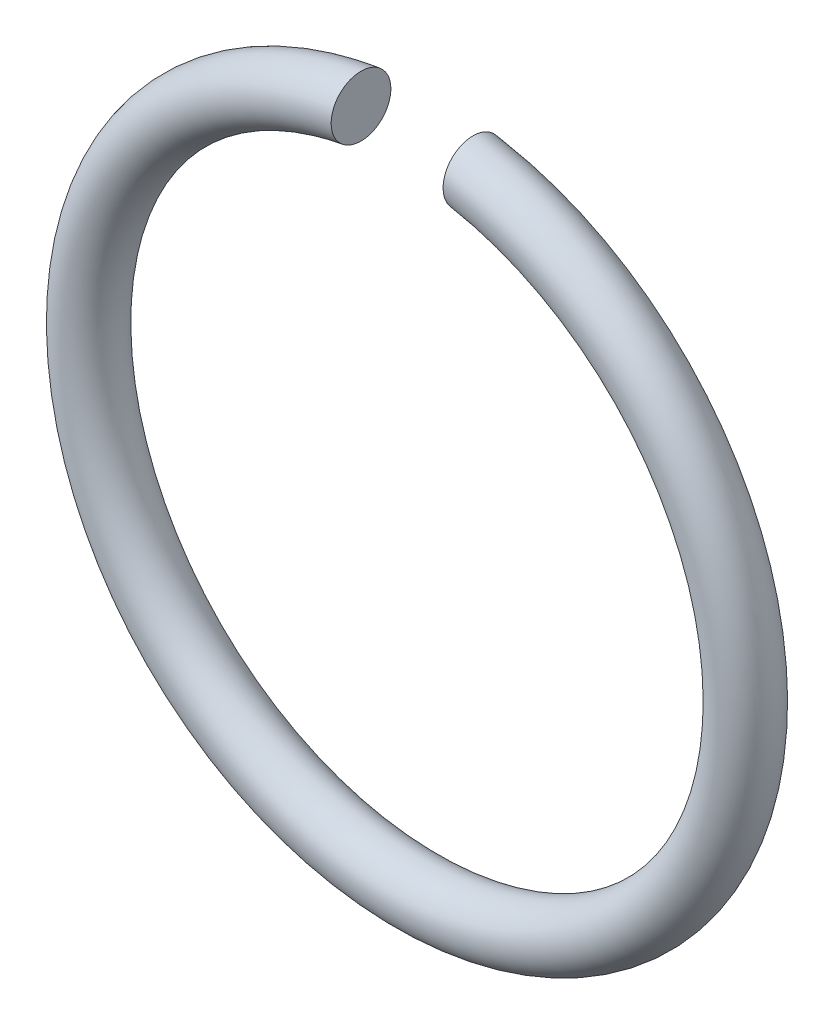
ISO-10303-21;
HEADER;
FILE_DESCRIPTION(('STEP AP214'),'2;1');
FILE_NAME('part.step','',(''),(''),'','','');
FILE_SCHEMA(('AUTOMOTIVE_DESIGN { 1 0 10303 214 1 1 1 1 }'));
ENDSEC;
DATA;
#1=APPLICATION_CONTEXT('core data for automotive mechanical design processes');
#2=APPLICATION_PROTOCOL_DEFINITION('international standard','automotive_design',2000,#1);
#3=PRODUCT_CONTEXT('',#1,'mechanical');
#4=PRODUCT('Part','Part','',(#3));
#5=PRODUCT_RELATED_PRODUCT_CATEGORY('part','',(#4));
#6=PRODUCT_DEFINITION_FORMATION('','',#4);
#7=PRODUCT_DEFINITION_CONTEXT('part definition',#1,'design');
#8=PRODUCT_DEFINITION('design','',#6,#7);
#9=PRODUCT_DEFINITION_SHAPE('','',#8);
#10=(LENGTH_UNIT() NAMED_UNIT(*) SI_UNIT(.MILLI.,.METRE.));
#11=(NAMED_UNIT(*) PLANE_ANGLE_UNIT() SI_UNIT($,.RADIAN.));
#12=(NAMED_UNIT(*) SI_UNIT($,.STERADIAN.) SOLID_ANGLE_UNIT());
#13=UNCERTAINTY_MEASURE_WITH_UNIT(LENGTH_MEASURE(1.E-05),#10,'distance_accuracy_value','');
#14=(GEOMETRIC_REPRESENTATION_CONTEXT(3) GLOBAL_UNCERTAINTY_ASSIGNED_CONTEXT((#13)) GLOBAL_UNIT_ASSIGNED_CONTEXT((#10,
#11,#12)) REPRESENTATION_CONTEXT('',''));
#15=CARTESIAN_POINT('',(0.,0.,0.));
#16=DIRECTION('',(0.,0.,1.));
#17=DIRECTION('',(1.,0.,0.));
#18=AXIS2_PLACEMENT_3D('',#15,#16,#17);
#19=CARTESIAN_POINT('',(0.,0.,0.));
#20=DIRECTION('',(0.,0.,-1.));
#21=DIRECTION('',(-1.,0.,0.));
#22=AXIS2_PLACEMENT_3D('',#19,#20,#21);
#23=TOROIDAL_SURFACE('',#22,8.8,0.800000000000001);
#24=CARTESIAN_POINT('',(1.5,7.90165695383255,-0.258081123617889));
#25=CARTESIAN_POINT('',(1.5,7.91638539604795,-0.300530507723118));
#26=CARTESIAN_POINT('',(1.5,7.93475311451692,-0.341754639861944));
#27=CARTESIAN_POINT('',(1.5,7.9781958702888,-0.420548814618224));
#28=CARTESIAN_POINT('',(1.5,8.00327995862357,-0.458113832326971));
#29=CARTESIAN_POINT('',(1.5,8.05934880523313,-0.528475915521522));
#30=CARTESIAN_POINT('',(1.5,8.09032663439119,-0.561278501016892));
#31=CARTESIAN_POINT('',(1.5,8.15728000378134,-0.621283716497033));
#32=CARTESIAN_POINT('',(1.5,8.19325437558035,-0.648487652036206));
#33=CARTESIAN_POINT('',(1.5,8.26965043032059,-0.696900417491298));
#34=CARTESIAN_POINT('',(1.5,8.31012096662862,-0.718032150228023));
#35=CARTESIAN_POINT('',(1.5,8.39400329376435,-0.753306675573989));
#36=CARTESIAN_POINT('',(1.5,8.43741542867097,-0.767448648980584));
#37=CARTESIAN_POINT('',(1.5,8.52657566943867,-0.788518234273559));
#38=CARTESIAN_POINT('',(1.5,8.57234735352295,-0.795346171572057));
#39=CARTESIAN_POINT('',(1.5,8.66438925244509,-0.801261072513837));
#40=CARTESIAN_POINT('',(1.5,8.71065948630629,-0.800347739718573));
#41=CARTESIAN_POINT('',(1.5,8.80261156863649,-0.79076964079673));
#42=CARTESIAN_POINT('',(1.5,8.84828965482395,-0.782068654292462));
#43=CARTESIAN_POINT('',(1.5,8.93752381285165,-0.757082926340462));
#44=CARTESIAN_POINT('',(1.5,8.98107992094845,-0.740798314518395));
#45=CARTESIAN_POINT('',(1.5,9.06458741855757,-0.701174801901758));
#46=CARTESIAN_POINT('',(1.5,9.10455592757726,-0.677872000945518));
#47=CARTESIAN_POINT('',(1.5,9.17995300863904,-0.624812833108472));
#48=CARTESIAN_POINT('',(1.5,9.21538183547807,-0.595056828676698));
#49=CARTESIAN_POINT('',(1.5,9.28025162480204,-0.53029858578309));
#50=CARTESIAN_POINT('',(1.5,9.30975695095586,-0.495360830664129));
#51=CARTESIAN_POINT('',(1.5,9.36239205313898,-0.420973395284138));
#52=CARTESIAN_POINT('',(1.5,9.38552229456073,-0.381524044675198));
#53=CARTESIAN_POINT('',(1.5,9.4244428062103,-0.29977746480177));
#54=CARTESIAN_POINT('',(1.5,9.44032325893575,-0.257523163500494));
#55=CARTESIAN_POINT('',(1.5,9.46469017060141,-0.170934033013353));
#56=CARTESIAN_POINT('',(1.5,9.4731770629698,-0.126599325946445));
#57=CARTESIAN_POINT('',(1.5,9.48245250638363,-0.0375463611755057));
#58=CARTESIAN_POINT('',(1.5,9.48331130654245,0.00716459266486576));
#59=CARTESIAN_POINT('',(1.5,9.47748864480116,0.0960918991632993));
#60=CARTESIAN_POINT('',(1.5,9.47080737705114,0.140308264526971));
#61=CARTESIAN_POINT('',(1.5,9.45013486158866,0.22687545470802));
#62=CARTESIAN_POINT('',(1.5,9.4361625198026,0.269230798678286));
#63=CARTESIAN_POINT('',(1.5,9.40133814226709,0.351010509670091));
#64=CARTESIAN_POINT('',(1.5,9.38048601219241,0.390434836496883));
#65=CARTESIAN_POINT('',(1.5,9.3324027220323,0.465445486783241));
#66=CARTESIAN_POINT('',(1.5,9.3051415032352,0.501012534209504));
#67=CARTESIAN_POINT('',(1.5,9.24509217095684,0.567124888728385));
#68=CARTESIAN_POINT('',(1.5,9.2123037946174,0.597669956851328));
#69=CARTESIAN_POINT('',(1.5,9.14176537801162,0.653223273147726));
#70=CARTESIAN_POINT('',(1.5,9.10396647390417,0.678169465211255));
#71=CARTESIAN_POINT('',(1.5,9.02475920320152,0.721455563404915));
#72=CARTESIAN_POINT('',(1.5,8.98335059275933,0.739795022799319));
#73=CARTESIAN_POINT('',(1.5,8.8975293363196,0.769593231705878));
#74=CARTESIAN_POINT('',(1.5,8.85308489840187,0.780960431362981));
#75=CARTESIAN_POINT('',(1.5,8.76292524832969,0.796156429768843));
#76=CARTESIAN_POINT('',(1.5,8.71720995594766,0.799984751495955));
#77=CARTESIAN_POINT('',(1.5,8.62530431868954,0.800015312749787));
#78=CARTESIAN_POINT('',(1.5,8.57911393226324,0.796138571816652));
#79=CARTESIAN_POINT('',(1.5,8.48803159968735,0.780710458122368));
#80=CARTESIAN_POINT('',(1.5,8.44313970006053,0.769158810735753));
#81=CARTESIAN_POINT('',(1.5,8.35580129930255,0.738643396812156));
#82=CARTESIAN_POINT('',(1.5,8.31336226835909,0.719658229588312));
#83=CARTESIAN_POINT('',(1.5,8.2323040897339,0.674783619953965));
#84=CARTESIAN_POINT('',(1.5,8.19368486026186,0.648894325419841));
#85=CARTESIAN_POINT('',(1.5,8.12167552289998,0.591121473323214));
#86=CARTESIAN_POINT('',(1.5,8.08825015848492,0.559281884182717));
#87=CARTESIAN_POINT('',(1.5,8.0273207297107,0.490367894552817));
#88=CARTESIAN_POINT('',(1.5,7.99981594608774,0.453294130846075));
#89=CARTESIAN_POINT('',(1.5,7.9519612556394,0.375564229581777));
#90=CARTESIAN_POINT('',(1.5,7.93150871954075,0.334971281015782));
#91=CARTESIAN_POINT('',(1.5,7.89783091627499,0.250877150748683));
#92=CARTESIAN_POINT('',(1.5,7.88460678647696,0.207375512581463));
#93=CARTESIAN_POINT('',(1.5,7.8659673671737,0.119438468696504));
#94=CARTESIAN_POINT('',(1.5,7.86043461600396,0.0750278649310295));
#95=CARTESIAN_POINT('',(1.5,7.85698243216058,-0.0140492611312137));
#96=CARTESIAN_POINT('',(1.5,7.85905304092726,-0.0587153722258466));
#97=CARTESIAN_POINT('',(1.5,7.86836008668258,-0.129263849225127));
#98=CARTESIAN_POINT('',(1.5,7.87318843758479,-0.155487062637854));
#99=CARTESIAN_POINT('',(1.5,7.88547037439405,-0.207310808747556));
#100=CARTESIAN_POINT('',(1.5,7.89292392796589,-0.232911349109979));
#101=CARTESIAN_POINT('',(1.5,7.90165695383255,-0.258081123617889));
#102=B_SPLINE_CURVE_WITH_KNOTS('',3,(#24,#25,#26,#27,#28,#29,#30,#31,#32,#33,#34,#35,#36,#37,
#38,#39,#40,#41,#42,#43,#44,#45,#46,#47,#48,#49,#50,#51,#52,#53,#54,#55,#56,#57,#58,#59,#60,#61,
#62,#63,#64,#65,#66,#67,#68,#69,#70,#71,#72,#73,#74,#75,#76,#77,#78,#79,#80,#81,#82,#83,#84,#85,
#86,#87,#88,#89,#90,#91,#92,#93,#94,#95,#96,#97,#98,#99,#100,#101),.UNSPECIFIED.,.T.,.F.,(4,2,2,
2,2,2,2,2,2,2,2,2,2,2,2,2,2,2,2,2,2,2,2,2,2,2,2,2,2,2,2,2,2,2,2,2,2,2,4),(0.,0.134696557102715,
0.269575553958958,0.404296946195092,0.538986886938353,0.675318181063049,0.811665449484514,
0.949848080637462,1.08803600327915,1.22686999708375,1.36570161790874,1.50383097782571,
1.64195258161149,1.7784807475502,1.91499894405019,2.04976929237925,2.18453173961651,
2.31805182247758,2.4515684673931,2.58474060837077,2.71791457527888,2.85172604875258,
2.98554388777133,3.12077876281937,3.25602278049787,3.39300660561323,3.52999909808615,
3.66840306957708,3.80681199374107,3.94562235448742,4.08442974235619,4.22224932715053,
4.3600521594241,4.49575537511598,4.63147993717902,4.76510807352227,4.89856125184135,
4.97842869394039,5.05829515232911),.UNSPECIFIED.);
#103=CARTESIAN_POINT('',(1.5,7.90165695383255,-0.258081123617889));
#104=VERTEX_POINT('',#103);
#105=EDGE_CURVE('E37',#104,#104,#102,.T.);
#106=ORIENTED_EDGE('',*,*,#105,.T.);
#107=EDGE_LOOP('',(#106));
#108=FACE_BOUND('',#107,.T.);
#109=CARTESIAN_POINT('',(-1.5,7.90165695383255,-0.258081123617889));
#110=CARTESIAN_POINT('',(-1.5,7.88716777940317,-0.216308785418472));
#111=CARTESIAN_POINT('',(-1.5,7.87618104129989,-0.173289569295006));
#112=CARTESIAN_POINT('',(-1.5,7.86158076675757,-0.085983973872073));
#113=CARTESIAN_POINT('',(-1.5,7.85797511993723,-0.041696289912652));
#114=CARTESIAN_POINT('',(-1.5,7.85826694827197,0.0468417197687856));
#115=CARTESIAN_POINT('',(-1.5,7.86216165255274,0.0910920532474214));
#116=CARTESIAN_POINT('',(-1.5,7.87732537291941,0.178298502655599));
#117=CARTESIAN_POINT('',(-1.5,7.88859282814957,0.221254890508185));
#118=CARTESIAN_POINT('',(-1.5,7.91815034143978,0.304688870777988));
#119=CARTESIAN_POINT('',(-1.5,7.93644209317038,0.345165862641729));
#120=CARTESIAN_POINT('',(-1.5,7.97948977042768,0.422522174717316));
#121=CARTESIAN_POINT('',(-1.5,8.00424620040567,0.459401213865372));
#122=CARTESIAN_POINT('',(-1.5,8.05979940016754,0.528964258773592));
#123=CARTESIAN_POINT('',(-1.5,8.0906603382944,0.56159699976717));
#124=CARTESIAN_POINT('',(-1.5,8.15734377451,0.621321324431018));
#125=CARTESIAN_POINT('',(-1.5,8.19316668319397,0.648412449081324));
#126=CARTESIAN_POINT('',(-1.5,8.26938863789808,0.696754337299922));
#127=CARTESIAN_POINT('',(-1.5,8.30985324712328,0.717901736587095));
#128=CARTESIAN_POINT('',(-1.5,8.39372466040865,0.753207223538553));
#129=CARTESIAN_POINT('',(-1.5,8.43713169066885,0.767364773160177));
#130=CARTESIAN_POINT('',(-1.5,8.52628383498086,0.788466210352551));
#131=CARTESIAN_POINT('',(-1.5,8.57205254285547,0.795310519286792));
#132=CARTESIAN_POINT('',(-1.5,8.66409133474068,0.801258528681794));
#133=CARTESIAN_POINT('',(-1.5,8.71036143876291,0.800361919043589));
#134=CARTESIAN_POINT('',(-1.5,8.80231651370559,0.790817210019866));
#135=CARTESIAN_POINT('',(-1.5,8.84799772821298,0.782132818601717));
#136=CARTESIAN_POINT('',(-1.5,8.93724101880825,0.757179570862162));
#137=CARTESIAN_POINT('',(-1.5,8.98080312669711,0.7409108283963));
#138=CARTESIAN_POINT('',(-1.5,9.06432561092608,0.701317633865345));
#139=CARTESIAN_POINT('',(-1.5,9.1043030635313,0.678029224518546));
#140=CARTESIAN_POINT('',(-1.5,9.17972032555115,0.624997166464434));
#141=CARTESIAN_POINT('',(-1.5,9.21516039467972,0.595253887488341));
#142=CARTESIAN_POINT('',(-1.5,9.28005472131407,0.530518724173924));
#143=CARTESIAN_POINT('',(-1.5,9.30957329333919,0.495591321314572));
#144=CARTESIAN_POINT('',(-1.5,9.3622364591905,0.421222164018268));
#145=CARTESIAN_POINT('',(-1.5,9.38538151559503,0.381780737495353));
#146=CARTESIAN_POINT('',(-1.5,9.42433253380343,0.300047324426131));
#147=CARTESIAN_POINT('',(-1.5,9.44022867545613,0.257798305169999));
#148=CARTESIAN_POINT('',(-1.5,9.46462758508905,0.171216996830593));
#149=CARTESIAN_POINT('',(-1.5,9.47313078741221,0.126884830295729));
#150=CARTESIAN_POINT('',(-1.5,9.48243878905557,0.0378343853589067));
#151=CARTESIAN_POINT('',(-1.5,9.48331388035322,-0.00687655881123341));
#152=CARTESIAN_POINT('',(-1.5,9.4775235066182,-0.0958065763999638));
#153=CARTESIAN_POINT('',(-1.5,9.47085823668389,-0.140025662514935));
#154=CARTESIAN_POINT('',(-1.5,9.45021698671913,-0.226600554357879));
#155=CARTESIAN_POINT('',(-1.5,9.43625997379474,-0.268960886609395));
#156=CARTESIAN_POINT('',(-1.5,9.40146514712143,-0.350753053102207));
#157=CARTESIAN_POINT('',(-1.5,9.38062723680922,-0.390184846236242));
#158=CARTESIAN_POINT('',(-1.5,9.3325711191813,-0.465212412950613));
#159=CARTESIAN_POINT('',(-1.5,9.30532289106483,-0.500788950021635));
#160=CARTESIAN_POINT('',(-1.5,9.2452977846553,-0.566922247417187));
#161=CARTESIAN_POINT('',(-1.5,9.21252064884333,-0.597478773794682));
#162=CARTESIAN_POINT('',(-1.5,9.14200292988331,-0.653056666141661));
#163=CARTESIAN_POINT('',(-1.5,9.10421348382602,-0.678016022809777));
#164=CARTESIAN_POINT('',(-1.5,9.02502275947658,-0.721329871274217));
#165=CARTESIAN_POINT('',(-1.5,8.98362123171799,-0.73968390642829));
#166=CARTESIAN_POINT('',(-1.5,8.89781181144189,-0.769512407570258));
#167=CARTESIAN_POINT('',(-1.5,8.85337209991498,-0.780895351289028));
#168=CARTESIAN_POINT('',(-1.5,8.76321910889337,-0.796123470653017));
#169=CARTESIAN_POINT('',(-1.5,8.71750574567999,-0.79996814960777));
#170=CARTESIAN_POINT('',(-1.5,8.6256001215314,-0.800031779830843));
#171=CARTESIAN_POINT('',(-1.5,8.57940779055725,-0.796171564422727));
#172=CARTESIAN_POINT('',(-1.5,8.48832063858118,-0.780776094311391));
#173=CARTESIAN_POINT('',(-1.5,8.44342581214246,-0.769240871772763));
#174=CARTESIAN_POINT('',(-1.5,8.35608296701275,-0.738759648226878));
#175=CARTESIAN_POINT('',(-1.5,8.31364216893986,-0.719792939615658));
#176=CARTESIAN_POINT('',(-1.5,8.23256620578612,-0.674948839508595));
#177=CARTESIAN_POINT('',(-1.5,8.19393190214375,-0.649069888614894));
#178=CARTESIAN_POINT('',(-1.5,8.12187630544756,-0.591304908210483));
#179=CARTESIAN_POINT('',(-1.5,8.08842209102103,-0.559459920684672));
#180=CARTESIAN_POINT('',(-1.5,8.02746897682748,-0.490551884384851));
#181=CARTESIAN_POINT('',(-1.5,7.99996238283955,-0.453495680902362));
#182=CARTESIAN_POINT('',(-1.5,7.9606964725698,-0.389775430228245));
#183=CARTESIAN_POINT('',(-1.5,7.94688057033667,-0.364354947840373));
#184=CARTESIAN_POINT('',(-1.5,7.9220965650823,-0.312160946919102));
#185=CARTESIAN_POINT('',(-1.5,7.91112843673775,-0.285387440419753));
#186=CARTESIAN_POINT('',(-1.5,7.90165695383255,-0.258081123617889));
#187=B_SPLINE_CURVE_WITH_KNOTS('',3,(#109,#110,#111,#112,#113,#114,#115,#116,#117,#118,#119,
#120,#121,#122,#123,#124,#125,#126,#127,#128,#129,#130,#131,#132,#133,#134,#135,#136,#137,#138,
#139,#140,#141,#142,#143,#144,#145,#146,#147,#148,#149,#150,#151,#152,#153,#154,#155,#156,#157,
#158,#159,#160,#161,#162,#163,#164,#165,#166,#167,#168,#169,#170,#171,#172,#173,#174,#175,#176,
#177,#178,#179,#180,#181,#182,#183,#184,#185,#186),.UNSPECIFIED.,.T.,.F.,(4,2,2,2,2,2,2,2,2,2,2,
2,2,2,2,2,2,2,2,2,2,2,2,2,2,2,2,2,2,2,2,2,2,2,2,2,2,2,4),(0.,0.132536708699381,
0.265215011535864,0.397844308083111,0.530445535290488,0.663078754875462,0.795722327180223,
0.929842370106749,1.06397351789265,1.20031031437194,1.33665760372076,1.47483865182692,
1.61302523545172,1.75185915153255,1.8906909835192,2.02882178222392,2.16694467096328,
2.30347474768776,2.43999491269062,2.5747669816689,2.70953113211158,2.84305212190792,
2.97656965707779,3.10974160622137,3.24291542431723,3.37672579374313,3.51054239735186,
3.64577536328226,3.78101767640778,3.91799949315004,4.05499033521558,4.19339598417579,
4.33180105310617,4.47059455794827,4.60941940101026,4.74732214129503,4.88504540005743,
4.97168458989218,5.05832300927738),.UNSPECIFIED.);
#188=CARTESIAN_POINT('',(-1.5,7.90165695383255,-0.258081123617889));
#189=VERTEX_POINT('',#188);
#190=EDGE_CURVE('E10',#189,#189,#187,.T.);
#191=ORIENTED_EDGE('',*,*,#190,.T.);
#192=EDGE_LOOP('',(#191));
#193=FACE_BOUND('',#192,.T.);
#194=ADVANCED_FACE('F28',(#108,#193),#23,.T.);
#195=CARTESIAN_POINT('',(1.5,0.,-0.800000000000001));
#196=DIRECTION('',(1.,0.,0.));
#197=DIRECTION('',(0.,0.,-1.));
#198=AXIS2_PLACEMENT_3D('',#195,#196,#197);
#199=PLANE('',#198);
#200=ORIENTED_EDGE('',*,*,#105,.F.);
#201=EDGE_LOOP('',(#200));
#202=FACE_BOUND('',#201,.T.);
#203=ADVANCED_FACE('F46',(#202),#199,.F.);
#204=CARTESIAN_POINT('',(-1.5,0.,-0.800000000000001));
#205=DIRECTION('',(-1.,0.,0.));
#206=DIRECTION('',(0.,0.,1.));
#207=AXIS2_PLACEMENT_3D('',#204,#205,#206);
#208=PLANE('',#207);
#209=ORIENTED_EDGE('',*,*,#190,.F.);
#210=EDGE_LOOP('',(#209));
#211=FACE_BOUND('',#210,.T.);
#212=ADVANCED_FACE('F49',(#211),#208,.F.);
#213=CLOSED_SHELL('',(#194,#203,#212));
#214=MANIFOLD_SOLID_BREP('B2',#213);
#215=ADVANCED_BREP_SHAPE_REPRESENTATION('',(#18,#214),#14);
#216=SHAPE_DEFINITION_REPRESENTATION(#9,#215);
ENDSEC;
END-ISO-10303-21;
